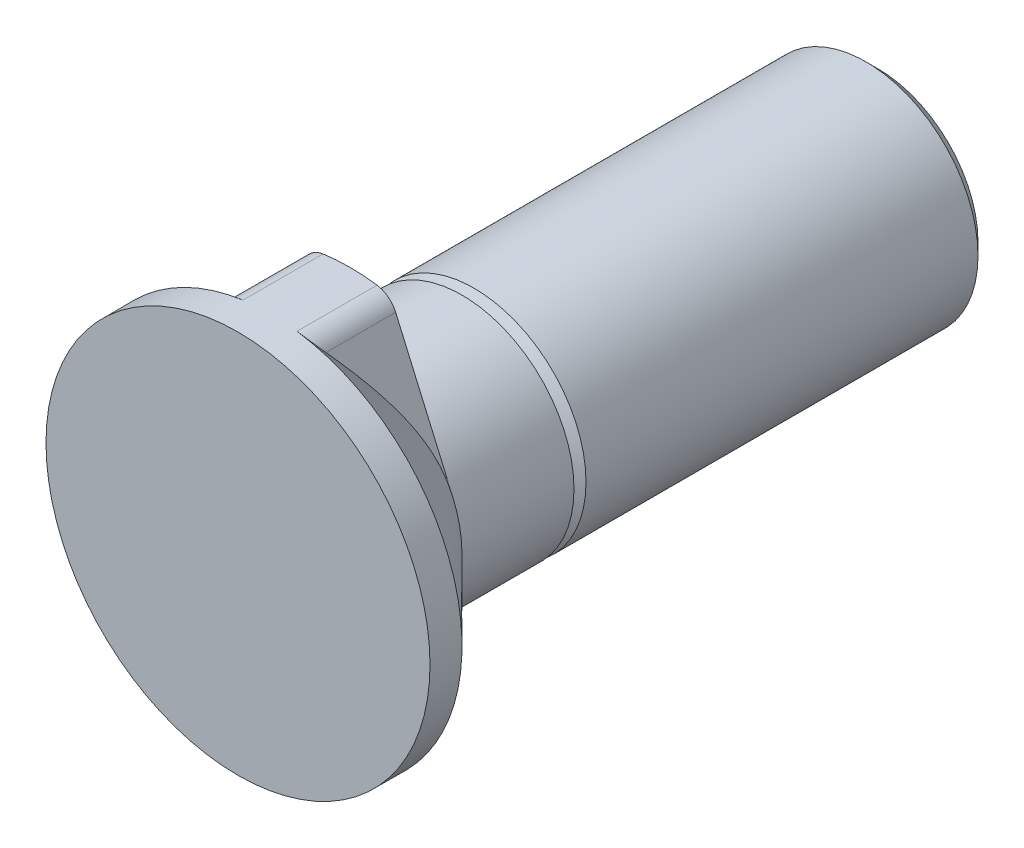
ISO-10303-21;
HEADER;
FILE_DESCRIPTION(('STEP AP214'),'2;1');
FILE_NAME('part.step','',(''),(''),'','','');
FILE_SCHEMA(('AUTOMOTIVE_DESIGN { 1 0 10303 214 1 1 1 1 }'));
ENDSEC;
DATA;
#1=APPLICATION_CONTEXT('core data for automotive mechanical design processes');
#2=APPLICATION_PROTOCOL_DEFINITION('international standard','automotive_design',2000,#1);
#3=PRODUCT_CONTEXT('',#1,'mechanical');
#4=PRODUCT('Part','Part','',(#3));
#5=PRODUCT_RELATED_PRODUCT_CATEGORY('part','',(#4));
#6=PRODUCT_DEFINITION_FORMATION('','',#4);
#7=PRODUCT_DEFINITION_CONTEXT('part definition',#1,'design');
#8=PRODUCT_DEFINITION('design','',#6,#7);
#9=PRODUCT_DEFINITION_SHAPE('','',#8);
#10=(LENGTH_UNIT() NAMED_UNIT(*) SI_UNIT(.MILLI.,.METRE.));
#11=(NAMED_UNIT(*) PLANE_ANGLE_UNIT() SI_UNIT($,.RADIAN.));
#12=(NAMED_UNIT(*) SI_UNIT($,.STERADIAN.) SOLID_ANGLE_UNIT());
#13=UNCERTAINTY_MEASURE_WITH_UNIT(LENGTH_MEASURE(1.E-05),#10,'distance_accuracy_value','');
#14=(GEOMETRIC_REPRESENTATION_CONTEXT(3) GLOBAL_UNCERTAINTY_ASSIGNED_CONTEXT((#13)) GLOBAL_UNIT_ASSIGNED_CONTEXT((#10,
#11,#12)) REPRESENTATION_CONTEXT('',''));
#15=CARTESIAN_POINT('',(0.,0.,0.));
#16=DIRECTION('',(0.,0.,1.));
#17=DIRECTION('',(1.,0.,0.));
#18=AXIS2_PLACEMENT_3D('',#15,#16,#17);
#19=CARTESIAN_POINT('',(0.,0.,-2.));
#20=DIRECTION('',(0.,0.,1.));
#21=DIRECTION('',(1.,0.,0.));
#22=AXIS2_PLACEMENT_3D('',#19,#20,#21);
#23=CONICAL_SURFACE('',#22,12.,0.785398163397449);
#24=CARTESIAN_POINT('',(0.,0.,-7.));
#25=DIRECTION('',(0.,0.,-1.));
#26=DIRECTION('',(-1.,0.,0.));
#27=AXIS2_PLACEMENT_3D('',#24,#25,#26);
#28=CIRCLE('',#27,7.);
#29=CARTESIAN_POINT('',(-6.41942052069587,-2.79124348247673,-7.));
#30=VERTEX_POINT('',#29);
#31=CARTESIAN_POINT('',(-6.41942052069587,2.79124348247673,-7.));
#32=VERTEX_POINT('',#31);
#33=EDGE_CURVE('E121',#30,#32,#28,.T.);
#34=ORIENTED_EDGE('',*,*,#33,.F.);
#35=CARTESIAN_POINT('',(-6.41950748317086,-2.79104348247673,-6.99999999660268));
#36=CARTESIAN_POINT('',(-6.37658002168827,-2.88976988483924,-7.0000158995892));
#37=CARTESIAN_POINT('',(-6.33365424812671,-2.98849240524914,-6.99752353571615));
#38=CARTESIAN_POINT('',(-6.24789997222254,-3.185713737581,-6.98761549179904));
#39=CARTESIAN_POINT('',(-6.20507145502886,-3.28421258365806,-6.98020062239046));
#40=CARTESIAN_POINT('',(-6.11967789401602,-3.48060432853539,-6.96056062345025));
#41=CARTESIAN_POINT('',(-6.07711249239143,-3.57849805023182,-6.94834525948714));
#42=CARTESIAN_POINT('',(-5.99223564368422,-3.77370143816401,-6.91928049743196));
#43=CARTESIAN_POINT('',(-5.9499242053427,-3.8710110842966,-6.9024309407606));
#44=CARTESIAN_POINT('',(-5.82496020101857,-4.15840861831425,-6.84592087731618));
#45=CARTESIAN_POINT('',(-5.74275261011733,-4.3474731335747,-6.79993211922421));
#46=CARTESIAN_POINT('',(-5.57990153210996,-4.72200497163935,-6.6928996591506));
#47=CARTESIAN_POINT('',(-5.49925881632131,-4.90747052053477,-6.63184872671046));
#48=CARTESIAN_POINT('',(-5.332023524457,-5.29208536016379,-6.49040662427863));
#49=CARTESIAN_POINT('',(-5.24560652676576,-5.49083084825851,-6.4087186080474));
#50=CARTESIAN_POINT('',(-5.07485190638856,-5.88353958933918,-6.23263024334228));
#51=CARTESIAN_POINT('',(-4.99051489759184,-6.0775014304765,-6.13822619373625));
#52=CARTESIAN_POINT('',(-4.82368633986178,-6.46118084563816,-5.93892547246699));
#53=CARTESIAN_POINT('',(-4.74119792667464,-6.65089120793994,-5.83401241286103));
#54=CARTESIAN_POINT('',(-4.57803275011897,-7.02614542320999,-5.61577938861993));
#55=CARTESIAN_POINT('',(-4.4973557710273,-7.21168977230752,-5.50246043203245));
#56=CARTESIAN_POINT('',(-4.33633561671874,-7.58201077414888,-5.26711087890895));
#57=CARTESIAN_POINT('',(-4.25601805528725,-7.76672851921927,-5.14497057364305));
#58=CARTESIAN_POINT('',(-4.09683116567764,-8.13283330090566,-4.89490258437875));
#59=CARTESIAN_POINT('',(-4.01796187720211,-8.31422024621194,-4.76697474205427));
#60=CARTESIAN_POINT('',(-3.86155387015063,-8.67393403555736,-4.50646245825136));
#61=CARTESIAN_POINT('',(-3.78401410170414,-8.85226329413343,-4.3738819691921));
#62=CARTESIAN_POINT('',(-3.63003731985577,-9.20638564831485,-4.10477176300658));
#63=CARTESIAN_POINT('',(-3.5536002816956,-9.38217880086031,-3.96824213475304));
#64=CARTESIAN_POINT('',(-3.39635594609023,-9.74381601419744,-3.68217594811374));
#65=CARTESIAN_POINT('',(-3.31561832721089,-9.92949982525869,-3.53239891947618));
#66=CARTESIAN_POINT('',(-3.15508921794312,-10.2986915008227,-3.22966849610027));
#67=CARTESIAN_POINT('',(-3.07529778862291,-10.4821992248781,-3.07671489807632));
#68=CARTESIAN_POINT('',(-2.91799877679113,-10.843962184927,-2.77097687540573));
#69=CARTESIAN_POINT('',(-2.84047616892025,-11.0222519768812,-2.6182409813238));
#70=CARTESIAN_POINT('',(-2.68613842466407,-11.377204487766,-2.31058395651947));
#71=CARTESIAN_POINT('',(-2.60932320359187,-11.5538674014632,-2.15566309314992));
#72=CARTESIAN_POINT('',(-2.53280838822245,-11.7298394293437,-1.99982286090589));
#73=B_SPLINE_CURVE_WITH_KNOTS('',3,(#35,#36,#37,#38,#39,#40,#41,#42,#43,#44,#45,#46,#47,#48,#49,
#50,#51,#52,#53,#54,#55,#56,#57,#58,#59,#60,#61,#62,#63,#64,#65,#66,#67,#68,#69,#70,#71,#72),
.UNSPECIFIED.,.F.,.F.,(4,2,2,2,2,2,2,2,2,2,2,2,2,2,2,2,2,2,4),(0.,0.32292990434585,
0.645806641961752,0.968029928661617,1.29026424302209,1.92324158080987,2.55652336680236,
3.25083605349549,3.94535126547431,4.64096689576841,5.33649924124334,6.04306902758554,
6.74965815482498,7.45566091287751,8.16164779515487,8.9171711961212,9.67274309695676,
10.4144319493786,11.1560308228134),.UNSPECIFIED.);
#74=CARTESIAN_POINT('',(-2.85290042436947,-10.9936781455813,-2.64218330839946));
#75=VERTEX_POINT('',#74);
#76=EDGE_CURVE('E110',#30,#75,#73,.T.);
#77=ORIENTED_EDGE('',*,*,#76,.T.);
#78=CARTESIAN_POINT('',(-2.85290042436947,-10.9936781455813,-2.64218330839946));
#79=CARTESIAN_POINT('',(-2.82054452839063,-11.068101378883,-2.5782519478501));
#80=CARTESIAN_POINT('',(-2.78123892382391,-11.1419287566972,-2.51635410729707));
#81=CARTESIAN_POINT('',(-2.68754612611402,-11.2859387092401,-2.3986540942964));
#82=CARTESIAN_POINT('',(-2.63303332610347,-11.3560848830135,-2.34290833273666));
#83=CARTESIAN_POINT('',(-2.52327720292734,-11.4729270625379,-2.2530114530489));
#84=CARTESIAN_POINT('',(-2.47136558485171,-11.5212044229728,-2.21689174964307));
#85=CARTESIAN_POINT('',(-2.35863477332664,-11.6114748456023,-2.15156675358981));
#86=CARTESIAN_POINT('',(-2.29783659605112,-11.6534822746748,-2.12234556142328));
#87=CARTESIAN_POINT('',(-2.16731075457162,-11.729597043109,-2.07206814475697));
#88=CARTESIAN_POINT('',(-2.09749042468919,-11.7636103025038,-2.0511073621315));
#89=CARTESIAN_POINT('',(-1.95142195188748,-11.8207989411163,-2.01945364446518));
#90=CARTESIAN_POINT('',(-1.8751916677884,-11.8440033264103,-2.00873314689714));
#91=CARTESIAN_POINT('',(-1.77937357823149,-11.864943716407,-2.00238722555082));
#92=CARTESIAN_POINT('',(-1.76125056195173,-11.8685523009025,-2.00149207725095));
#93=CARTESIAN_POINT('',(-1.72488866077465,-11.8750960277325,-2.00029960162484));
#94=CARTESIAN_POINT('',(-1.7066499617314,-11.8780320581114,-2.00000148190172));
#95=CARTESIAN_POINT('',(-1.68835464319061,-11.8806337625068,-2.));
#96=B_SPLINE_CURVE_WITH_KNOTS('',3,(#78,#79,#80,#81,#82,#83,#84,#85,#86,#87,#88,#89,#90,#91,#92,
#93,#94,#95),.UNSPECIFIED.,.F.,.F.,(4,2,2,2,2,2,2,2,4),(0.,0.310466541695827,0.623577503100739,
0.861350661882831,1.09857033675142,1.33845571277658,1.57769358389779,1.63318188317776,
1.68859648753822),.UNSPECIFIED.);
#97=CARTESIAN_POINT('',(-1.68835464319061,-11.8806337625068,-2.));
#98=VERTEX_POINT('',#97);
#99=EDGE_CURVE('E189',#75,#98,#96,.T.);
#100=ORIENTED_EDGE('',*,*,#99,.T.);
#101=CARTESIAN_POINT('',(0.,0.,-2.));
#102=DIRECTION('',(0.,0.,-1.));
#103=DIRECTION('',(-1.,0.,0.));
#104=AXIS2_PLACEMENT_3D('',#101,#102,#103);
#105=CIRCLE('',#104,12.);
#106=CARTESIAN_POINT('',(-1.68835464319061,11.8806337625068,-2.));
#107=VERTEX_POINT('',#106);
#108=EDGE_CURVE('E126',#98,#107,#105,.T.);
#109=ORIENTED_EDGE('',*,*,#108,.T.);
#110=CARTESIAN_POINT('',(-1.68835464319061,11.8806337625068,-2.));
#111=CARTESIAN_POINT('',(-1.72274997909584,11.8757537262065,-1.99999374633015));
#112=CARTESIAN_POINT('',(-1.75696816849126,11.869664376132,-2.00105579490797));
#113=CARTESIAN_POINT('',(-1.82475897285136,11.8551688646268,-2.00526833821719));
#114=CARTESIAN_POINT('',(-1.85833195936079,11.8467640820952,-2.0084175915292));
#115=CARTESIAN_POINT('',(-1.92435104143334,11.8278000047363,-2.01672734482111));
#116=CARTESIAN_POINT('',(-1.95680337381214,11.8172561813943,-2.02187363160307));
#117=CARTESIAN_POINT('',(-2.02059154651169,11.7941246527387,-2.03408796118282));
#118=CARTESIAN_POINT('',(-2.05192727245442,11.7815367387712,-2.04115620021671));
#119=CARTESIAN_POINT('',(-2.14382582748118,11.7409988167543,-2.06505826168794));
#120=CARTESIAN_POINT('',(-2.20247673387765,11.7102170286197,-2.08461503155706));
#121=CARTESIAN_POINT('',(-2.31352778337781,11.6425478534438,-2.12997086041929));
#122=CARTESIAN_POINT('',(-2.36591673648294,11.6056498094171,-2.15578085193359));
#123=CARTESIAN_POINT('',(-2.4803825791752,11.513975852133,-2.22212442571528));
#124=CARTESIAN_POINT('',(-2.53981013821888,11.4573559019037,-2.26469231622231));
#125=CARTESIAN_POINT('',(-2.64650598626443,11.3386310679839,-2.35679411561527));
#126=CARTESIAN_POINT('',(-2.69375138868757,11.2765161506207,-2.40634086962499));
#127=CARTESIAN_POINT('',(-2.78153523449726,11.1413431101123,-2.51684909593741));
#128=CARTESIAN_POINT('',(-2.82061379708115,11.06786080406,-2.57846743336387));
#129=CARTESIAN_POINT('',(-2.85290042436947,10.9936781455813,-2.64218330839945));
#130=B_SPLINE_CURVE_WITH_KNOTS('',3,(#110,#111,#112,#113,#114,#115,#116,#117,#118,#119,#120,
#121,#122,#123,#124,#125,#126,#127,#128,#129),.UNSPECIFIED.,.F.,.F.,(4,2,2,2,2,2,2,2,2,4),(0.,
0.104173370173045,0.208284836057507,0.311668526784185,0.41506277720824,0.621239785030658,
0.827779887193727,1.10363624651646,1.38000714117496,1.68915382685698),.UNSPECIFIED.);
#131=CARTESIAN_POINT('',(-2.85290042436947,10.9936781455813,-2.64218330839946));
#132=VERTEX_POINT('',#131);
#133=EDGE_CURVE('E210',#107,#132,#130,.T.);
#134=ORIENTED_EDGE('',*,*,#133,.T.);
#135=CARTESIAN_POINT('',(-2.53280838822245,11.7298394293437,-1.99982286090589));
#136=CARTESIAN_POINT('',(-2.60420635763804,11.5656353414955,-2.14524478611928));
#137=CARTESIAN_POINT('',(-2.67586652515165,11.4008282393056,-2.28986320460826));
#138=CARTESIAN_POINT('',(-2.81979373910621,11.0698183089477,-2.57721138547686));
#139=CARTESIAN_POINT('',(-2.89206082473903,10.9036153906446,-2.71994102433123));
#140=CARTESIAN_POINT('',(-3.03739267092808,10.5693750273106,-3.00344037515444));
#141=CARTESIAN_POINT('',(-3.11045853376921,10.4013350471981,-3.14420653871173));
#142=CARTESIAN_POINT('',(-3.25736579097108,10.0634714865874,-3.42316662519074));
#143=CARTESIAN_POINT('',(-3.33120717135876,9.8936479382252,-3.56136059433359));
#144=CARTESIAN_POINT('',(-3.48242962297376,9.54586010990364,-3.8396079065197));
#145=CARTESIAN_POINT('',(-3.5598429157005,9.36782172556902,-3.97955133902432));
#146=CARTESIAN_POINT('',(-3.7157596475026,9.00923779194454,-4.25556289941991));
#147=CARTESIAN_POINT('',(-3.79426305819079,8.82869230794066,-4.39163112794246));
#148=CARTESIAN_POINT('',(-3.95248167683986,8.46481439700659,-4.65903041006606));
#149=CARTESIAN_POINT('',(-4.03219617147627,8.28148361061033,-4.79036410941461));
#150=CARTESIAN_POINT('',(-4.19306088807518,7.91152009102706,-5.04736118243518));
#151=CARTESIAN_POINT('',(-4.27421100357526,7.72488760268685,-5.17302497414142));
#152=CARTESIAN_POINT('',(-4.45618498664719,7.30637609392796,-5.4443009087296));
#153=CARTESIAN_POINT('',(-4.55741217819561,7.07356949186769,-5.58822565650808));
#154=CARTESIAN_POINT('',(-4.76274706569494,6.60133158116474,-5.86280798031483));
#155=CARTESIAN_POINT('',(-4.866855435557,6.36189872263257,-5.99346241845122));
#156=CARTESIAN_POINT('',(-5.07688683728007,5.87885956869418,-6.23586339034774));
#157=CARTESIAN_POINT('',(-5.1827678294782,5.63534995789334,-6.34783656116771));
#158=CARTESIAN_POINT('',(-5.39778269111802,5.14084963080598,-6.55002694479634));
#159=CARTESIAN_POINT('',(-5.50691439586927,4.88986389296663,-6.64025828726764));
#160=CARTESIAN_POINT('',(-5.68235093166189,4.48638748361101,-6.76174277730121));
#161=CARTESIAN_POINT('',(-5.74767567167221,4.33615086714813,-6.80194572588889));
#162=CARTESIAN_POINT('',(-5.879197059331,4.03367238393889,-6.87192043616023));
#163=CARTESIAN_POINT('',(-5.94539344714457,3.88143111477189,-6.90169523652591));
#164=CARTESIAN_POINT('',(-6.07935764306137,3.57333455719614,-6.95022483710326));
#165=CARTESIAN_POINT('',(-6.14713457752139,3.41745827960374,-6.96882419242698));
#166=CARTESIAN_POINT('',(-6.24909185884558,3.18297258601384,-6.9874959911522));
#167=CARTESIAN_POINT('',(-6.28314570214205,3.10465410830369,-6.99218208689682));
#168=CARTESIAN_POINT('',(-6.35130114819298,2.9479073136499,-6.99843723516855));
#169=CARTESIAN_POINT('',(-6.38540275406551,2.86947898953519,-7.00000607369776));
#170=CARTESIAN_POINT('',(-6.41950748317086,2.79104348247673,-6.99999999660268));
#171=B_SPLINE_CURVE_WITH_KNOTS('',3,(#135,#136,#137,#138,#139,#140,#141,#142,#143,#144,#145,
#146,#147,#148,#149,#150,#151,#152,#153,#154,#155,#156,#157,#158,#159,#160,#161,#162,#163,#164,
#165,#166,#167,#168,#169,#170),.UNSPECIFIED.,.F.,.F.,(4,2,2,2,2,2,2,2,2,2,2,2,2,2,2,2,2,4),(0.,
0.692010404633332,1.38406584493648,2.07724205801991,2.77040580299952,3.48832962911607,
4.20623479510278,4.92373235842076,5.6411769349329,6.51633551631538,7.39170055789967,
8.25552108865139,9.11877871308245,9.62454457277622,10.1301629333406,10.6426605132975,
10.8992010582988,11.1557592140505),.UNSPECIFIED.);
#172=EDGE_CURVE('E142',#132,#32,#171,.T.);
#173=ORIENTED_EDGE('',*,*,#172,.T.);
#174=EDGE_LOOP('',(#34,#77,#100,#109,#134,#173));
#175=FACE_BOUND('',#174,.T.);
#176=ADVANCED_FACE('F17',(#175),#23,.T.);
#177=CARTESIAN_POINT('',(0.,0.,0.));
#178=DIRECTION('',(0.,0.,-1.));
#179=DIRECTION('',(-1.,0.,0.));
#180=AXIS2_PLACEMENT_3D('',#177,#178,#179);
#181=PLANE('',#180);
#182=CARTESIAN_POINT('',(0.,0.,0.));
#183=DIRECTION('',(0.,0.,-1.));
#184=DIRECTION('',(-1.,0.,0.));
#185=AXIS2_PLACEMENT_3D('',#182,#183,#184);
#186=CIRCLE('',#185,12.);
#187=CARTESIAN_POINT('',(-12.,0.,0.));
#188=VERTEX_POINT('',#187);
#189=EDGE_CURVE('E133',#188,#188,#186,.T.);
#190=ORIENTED_EDGE('',*,*,#189,.F.);
#191=EDGE_LOOP('',(#190));
#192=FACE_BOUND('',#191,.T.);
#193=ADVANCED_FACE('F19',(#192),#181,.F.);
#194=CARTESIAN_POINT('',(0.,0.,-50.));
#195=DIRECTION('',(0.,0.,-1.));
#196=DIRECTION('',(-1.,0.,0.));
#197=AXIS2_PLACEMENT_3D('',#194,#195,#196);
#198=CYLINDRICAL_SURFACE('',#197,12.);
#199=ORIENTED_EDGE('',*,*,#189,.T.);
#200=EDGE_LOOP('',(#199));
#201=FACE_BOUND('',#200,.T.);
#202=CARTESIAN_POINT('',(0.,0.,-7.));
#203=DIRECTION('',(0.,0.,1.));
#204=DIRECTION('',(1.,0.,0.));
#205=AXIS2_PLACEMENT_3D('',#202,#203,#204);
#206=CIRCLE('',#205,12.);
#207=CARTESIAN_POINT('',(-1.68835464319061,-11.8806337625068,-7.));
#208=VERTEX_POINT('',#207);
#209=CARTESIAN_POINT('',(1.68835464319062,-11.8806337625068,-7.));
#210=VERTEX_POINT('',#209);
#211=EDGE_CURVE('E102',#208,#210,#206,.T.);
#212=ORIENTED_EDGE('',*,*,#211,.T.);
#213=DIRECTION('',(0.,0.,-1.));
#214=VECTOR('',#213,1.);
#215=CARTESIAN_POINT('',(1.68835464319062,-11.8806337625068,-50.));
#216=LINE('',#215,#214);
#217=CARTESIAN_POINT('',(1.68835464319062,-11.8806337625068,-2.));
#218=VERTEX_POINT('',#217);
#219=EDGE_CURVE('E230',#210,#218,#216,.F.);
#220=ORIENTED_EDGE('',*,*,#219,.T.);
#221=CARTESIAN_POINT('',(1.68835464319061,11.8806337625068,-2.));
#222=VERTEX_POINT('',#221);
#223=EDGE_CURVE('E132',#222,#218,#105,.T.);
#224=ORIENTED_EDGE('',*,*,#223,.F.);
#225=DIRECTION('',(0.,0.,-1.));
#226=VECTOR('',#225,1.);
#227=CARTESIAN_POINT('',(1.68835464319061,11.8806337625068,-50.));
#228=LINE('',#227,#226);
#229=CARTESIAN_POINT('',(1.68835464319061,11.8806337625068,-7.));
#230=VERTEX_POINT('',#229);
#231=EDGE_CURVE('E220',#222,#230,#228,.T.);
#232=ORIENTED_EDGE('',*,*,#231,.T.);
#233=CARTESIAN_POINT('',(0.,0.,-7.));
#234=DIRECTION('',(0.,0.,1.));
#235=DIRECTION('',(1.,0.,0.));
#236=AXIS2_PLACEMENT_3D('',#233,#234,#235);
#237=CIRCLE('',#236,12.);
#238=CARTESIAN_POINT('',(-1.68835464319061,11.8806337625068,-7.));
#239=VERTEX_POINT('',#238);
#240=EDGE_CURVE('E550',#230,#239,#237,.T.);
#241=ORIENTED_EDGE('',*,*,#240,.T.);
#242=DIRECTION('',(0.,0.,-1.));
#243=VECTOR('',#242,1.);
#244=CARTESIAN_POINT('',(-1.68835464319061,11.8806337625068,-50.));
#245=LINE('',#244,#243);
#246=EDGE_CURVE('E195',#239,#107,#245,.F.);
#247=ORIENTED_EDGE('',*,*,#246,.T.);
#248=ORIENTED_EDGE('',*,*,#108,.F.);
#249=DIRECTION('',(0.,0.,-1.));
#250=VECTOR('',#249,1.);
#251=CARTESIAN_POINT('',(-1.68835464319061,-11.8806337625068,-50.));
#252=LINE('',#251,#250);
#253=EDGE_CURVE('E185',#98,#208,#252,.T.);
#254=ORIENTED_EDGE('',*,*,#253,.T.);
#255=EDGE_LOOP('',(#212,#220,#224,#232,#241,#247,#248,#254));
#256=FACE_BOUND('',#255,.T.);
#257=ADVANCED_FACE('F239',(#201,#256),#198,.T.);
#258=ORIENTED_EDGE('',*,*,#223,.T.);
#259=CARTESIAN_POINT('',(1.68835464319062,-11.8806337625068,-2.));
#260=CARTESIAN_POINT('',(1.72274997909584,-11.8757537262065,-1.99999374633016));
#261=CARTESIAN_POINT('',(1.75696816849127,-11.869664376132,-2.00105579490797));
#262=CARTESIAN_POINT('',(1.82475897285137,-11.8551688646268,-2.00526833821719));
#263=CARTESIAN_POINT('',(1.85833195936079,-11.8467640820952,-2.0084175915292));
#264=CARTESIAN_POINT('',(1.92435104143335,-11.8278000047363,-2.01672734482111));
#265=CARTESIAN_POINT('',(1.95680337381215,-11.8172561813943,-2.02187363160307));
#266=CARTESIAN_POINT('',(2.02059154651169,-11.7941246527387,-2.03408796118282));
#267=CARTESIAN_POINT('',(2.05192727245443,-11.7815367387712,-2.04115620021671));
#268=CARTESIAN_POINT('',(2.14382582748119,-11.7409988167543,-2.06505826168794));
#269=CARTESIAN_POINT('',(2.20247673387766,-11.7102170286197,-2.08461503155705));
#270=CARTESIAN_POINT('',(2.31352778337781,-11.6425478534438,-2.12997086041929));
#271=CARTESIAN_POINT('',(2.36591673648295,-11.6056498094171,-2.15578085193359));
#272=CARTESIAN_POINT('',(2.48038257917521,-11.513975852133,-2.22212442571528));
#273=CARTESIAN_POINT('',(2.53981013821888,-11.4573559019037,-2.26469231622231));
#274=CARTESIAN_POINT('',(2.64650598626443,-11.3386310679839,-2.35679411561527));
#275=CARTESIAN_POINT('',(2.69375138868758,-11.2765161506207,-2.40634086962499));
#276=CARTESIAN_POINT('',(2.78153523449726,-11.1413431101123,-2.51684909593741));
#277=CARTESIAN_POINT('',(2.82061379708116,-11.06786080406,-2.57846743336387));
#278=CARTESIAN_POINT('',(2.85290042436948,-10.9936781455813,-2.64218330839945));
#279=B_SPLINE_CURVE_WITH_KNOTS('',3,(#259,#260,#261,#262,#263,#264,#265,#266,#267,#268,#269,
#270,#271,#272,#273,#274,#275,#276,#277,#278),.UNSPECIFIED.,.F.,.F.,(4,2,2,2,2,2,2,2,2,4),(0.,
0.104173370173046,0.208284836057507,0.311668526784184,0.415062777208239,0.621239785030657,
0.827779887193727,1.10363624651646,1.38000714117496,1.68915382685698),.UNSPECIFIED.);
#280=CARTESIAN_POINT('',(2.85290042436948,-10.9936781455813,-2.64218330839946));
#281=VERTEX_POINT('',#280);
#282=EDGE_CURVE('E11',#218,#281,#279,.T.);
#283=ORIENTED_EDGE('',*,*,#282,.T.);
#284=CARTESIAN_POINT('',(2.53280838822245,-11.7298394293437,-1.99982286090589));
#285=CARTESIAN_POINT('',(2.60420635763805,-11.5656353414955,-2.14524478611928));
#286=CARTESIAN_POINT('',(2.67586652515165,-11.4008282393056,-2.28986320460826));
#287=CARTESIAN_POINT('',(2.81979373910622,-11.0698183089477,-2.57721138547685));
#288=CARTESIAN_POINT('',(2.89206082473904,-10.9036153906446,-2.71994102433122));
#289=CARTESIAN_POINT('',(3.03739267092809,-10.5693750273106,-3.00344037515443));
#290=CARTESIAN_POINT('',(3.11045853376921,-10.4013350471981,-3.14420653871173));
#291=CARTESIAN_POINT('',(3.25736579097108,-10.0634714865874,-3.42316662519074));
#292=CARTESIAN_POINT('',(3.33120717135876,-9.8936479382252,-3.56136059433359));
#293=CARTESIAN_POINT('',(3.48242962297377,-9.54586010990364,-3.8396079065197));
#294=CARTESIAN_POINT('',(3.55984291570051,-9.36782172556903,-3.97955133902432));
#295=CARTESIAN_POINT('',(3.7157596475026,-9.00923779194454,-4.25556289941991));
#296=CARTESIAN_POINT('',(3.7942630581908,-8.82869230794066,-4.39163112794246));
#297=CARTESIAN_POINT('',(3.95248167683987,-8.46481439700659,-4.65903041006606));
#298=CARTESIAN_POINT('',(4.03219617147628,-8.28148361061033,-4.79036410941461));
#299=CARTESIAN_POINT('',(4.19306088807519,-7.91152009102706,-5.04736118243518));
#300=CARTESIAN_POINT('',(4.27421100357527,-7.72488760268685,-5.17302497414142));
#301=CARTESIAN_POINT('',(4.4561849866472,-7.30637609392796,-5.4443009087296));
#302=CARTESIAN_POINT('',(4.55741217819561,-7.07356949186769,-5.58822565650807));
#303=CARTESIAN_POINT('',(4.76274706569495,-6.60133158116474,-5.86280798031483));
#304=CARTESIAN_POINT('',(4.86685543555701,-6.36189872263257,-5.99346241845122));
#305=CARTESIAN_POINT('',(5.07688683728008,-5.87885956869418,-6.23586339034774));
#306=CARTESIAN_POINT('',(5.18276782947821,-5.63534995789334,-6.3478365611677));
#307=CARTESIAN_POINT('',(5.39778269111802,-5.14084963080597,-6.55002694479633));
#308=CARTESIAN_POINT('',(5.50691439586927,-4.88986389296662,-6.64025828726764));
#309=CARTESIAN_POINT('',(5.6823509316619,-4.486387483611,-6.76174277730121));
#310=CARTESIAN_POINT('',(5.74767567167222,-4.33615086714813,-6.80194572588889));
#311=CARTESIAN_POINT('',(5.87919705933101,-4.03367238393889,-6.87192043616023));
#312=CARTESIAN_POINT('',(5.94539344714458,-3.88143111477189,-6.90169523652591));
#313=CARTESIAN_POINT('',(6.07935764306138,-3.57333455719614,-6.95022483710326));
#314=CARTESIAN_POINT('',(6.1471345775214,-3.41745827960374,-6.96882419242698));
#315=CARTESIAN_POINT('',(6.24909185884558,-3.18297258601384,-6.9874959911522));
#316=CARTESIAN_POINT('',(6.28314570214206,-3.10465410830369,-6.99218208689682));
#317=CARTESIAN_POINT('',(6.35130114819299,-2.9479073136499,-6.99843723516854));
#318=CARTESIAN_POINT('',(6.38540275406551,-2.86947898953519,-7.00000607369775));
#319=CARTESIAN_POINT('',(6.41950748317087,-2.79104348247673,-6.99999999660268));
#320=B_SPLINE_CURVE_WITH_KNOTS('',3,(#284,#285,#286,#287,#288,#289,#290,#291,#292,#293,#294,
#295,#296,#297,#298,#299,#300,#301,#302,#303,#304,#305,#306,#307,#308,#309,#310,#311,#312,#313,
#314,#315,#316,#317,#318,#319),.UNSPECIFIED.,.F.,.F.,(4,2,2,2,2,2,2,2,2,2,2,2,2,2,2,2,2,4),(0.,
0.692010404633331,1.38406584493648,2.07724205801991,2.77040580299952,3.48832962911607,
4.20623479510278,4.92373235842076,5.64117693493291,6.51633551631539,7.39170055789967,
8.2555210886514,9.11877871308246,9.62454457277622,10.1301629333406,10.6426605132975,
10.8992010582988,11.1557592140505),.UNSPECIFIED.);
#321=CARTESIAN_POINT('',(6.41942052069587,-2.79124348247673,-7.));
#322=VERTEX_POINT('',#321);
#323=EDGE_CURVE('E97',#281,#322,#320,.T.);
#324=ORIENTED_EDGE('',*,*,#323,.T.);
#325=CARTESIAN_POINT('',(6.41942052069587,2.79124348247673,-7.));
#326=VERTEX_POINT('',#325);
#327=EDGE_CURVE('E108',#326,#322,#28,.T.);
#328=ORIENTED_EDGE('',*,*,#327,.F.);
#329=CARTESIAN_POINT('',(6.41950748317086,2.79104348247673,-6.99999999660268));
#330=CARTESIAN_POINT('',(6.37658002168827,2.88976988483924,-7.0000158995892));
#331=CARTESIAN_POINT('',(6.33365424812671,2.98849240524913,-6.99752353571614));
#332=CARTESIAN_POINT('',(6.24789997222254,3.18571373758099,-6.98761549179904));
#333=CARTESIAN_POINT('',(6.20507145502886,3.28421258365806,-6.98020062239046));
#334=CARTESIAN_POINT('',(6.11967789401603,3.48060432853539,-6.96056062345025));
#335=CARTESIAN_POINT('',(6.07711249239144,3.57849805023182,-6.94834525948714));
#336=CARTESIAN_POINT('',(5.99223564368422,3.77370143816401,-6.91928049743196));
#337=CARTESIAN_POINT('',(5.9499242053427,3.8710110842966,-6.9024309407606));
#338=CARTESIAN_POINT('',(5.82496020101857,4.15840861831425,-6.84592087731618));
#339=CARTESIAN_POINT('',(5.74275261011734,4.3474731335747,-6.79993211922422));
#340=CARTESIAN_POINT('',(5.57990153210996,4.72200497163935,-6.6928996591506));
#341=CARTESIAN_POINT('',(5.49925881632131,4.90747052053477,-6.63184872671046));
#342=CARTESIAN_POINT('',(5.332023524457,5.29208536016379,-6.49040662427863));
#343=CARTESIAN_POINT('',(5.24560652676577,5.4908308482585,-6.4087186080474));
#344=CARTESIAN_POINT('',(5.07485190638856,5.88353958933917,-6.23263024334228));
#345=CARTESIAN_POINT('',(4.99051489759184,6.0775014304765,-6.13822619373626));
#346=CARTESIAN_POINT('',(4.82368633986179,6.46118084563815,-5.93892547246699));
#347=CARTESIAN_POINT('',(4.74119792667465,6.65089120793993,-5.83401241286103));
#348=CARTESIAN_POINT('',(4.57803275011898,7.02614542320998,-5.61577938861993));
#349=CARTESIAN_POINT('',(4.4973557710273,7.21168977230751,-5.50246043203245));
#350=CARTESIAN_POINT('',(4.33633561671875,7.58201077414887,-5.26711087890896));
#351=CARTESIAN_POINT('',(4.25601805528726,7.76672851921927,-5.14497057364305));
#352=CARTESIAN_POINT('',(4.09683116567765,8.13283330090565,-4.89490258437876));
#353=CARTESIAN_POINT('',(4.01796187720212,8.31422024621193,-4.76697474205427));
#354=CARTESIAN_POINT('',(3.86155387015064,8.67393403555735,-4.50646245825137));
#355=CARTESIAN_POINT('',(3.78401410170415,8.85226329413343,-4.37388196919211));
#356=CARTESIAN_POINT('',(3.63003731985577,9.20638564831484,-4.10477176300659));
#357=CARTESIAN_POINT('',(3.55360028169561,9.3821788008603,-3.96824213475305));
#358=CARTESIAN_POINT('',(3.39635594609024,9.74381601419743,-3.68217594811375));
#359=CARTESIAN_POINT('',(3.3156183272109,9.92949982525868,-3.53239891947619));
#360=CARTESIAN_POINT('',(3.15508921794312,10.2986915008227,-3.22966849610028));
#361=CARTESIAN_POINT('',(3.07529778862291,10.4821992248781,-3.07671489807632));
#362=CARTESIAN_POINT('',(2.91799877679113,10.843962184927,-2.77097687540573));
#363=CARTESIAN_POINT('',(2.84047616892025,11.0222519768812,-2.6182409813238));
#364=CARTESIAN_POINT('',(2.68613842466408,11.377204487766,-2.31058395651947));
#365=CARTESIAN_POINT('',(2.60932320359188,11.5538674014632,-2.15566309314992));
#366=CARTESIAN_POINT('',(2.53280838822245,11.7298394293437,-1.99982286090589));
#367=B_SPLINE_CURVE_WITH_KNOTS('',3,(#329,#330,#331,#332,#333,#334,#335,#336,#337,#338,#339,
#340,#341,#342,#343,#344,#345,#346,#347,#348,#349,#350,#351,#352,#353,#354,#355,#356,#357,#358,
#359,#360,#361,#362,#363,#364,#365,#366),.UNSPECIFIED.,.F.,.F.,(4,2,2,2,2,2,2,2,2,2,2,2,2,2,2,2,
2,2,4),(0.,0.322929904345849,0.645806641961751,0.968029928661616,1.29026424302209,
1.92324158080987,2.55652336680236,3.25083605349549,3.9453512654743,4.6409668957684,
5.33649924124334,6.04306902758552,6.74965815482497,7.45566091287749,8.16164779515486,
8.91717119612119,9.67274309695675,10.4144319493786,11.1560308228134),.UNSPECIFIED.);
#368=CARTESIAN_POINT('',(2.85290042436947,10.9936781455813,-2.64218330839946));
#369=VERTEX_POINT('',#368);
#370=EDGE_CURVE('E111',#326,#369,#367,.T.);
#371=ORIENTED_EDGE('',*,*,#370,.T.);
#372=CARTESIAN_POINT('',(2.85290042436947,10.9936781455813,-2.64218330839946));
#373=CARTESIAN_POINT('',(2.82054452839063,11.068101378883,-2.5782519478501));
#374=CARTESIAN_POINT('',(2.78123892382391,11.1419287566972,-2.51635410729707));
#375=CARTESIAN_POINT('',(2.68754612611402,11.2859387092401,-2.39865409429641));
#376=CARTESIAN_POINT('',(2.63303332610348,11.3560848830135,-2.34290833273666));
#377=CARTESIAN_POINT('',(2.52327720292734,11.4729270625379,-2.2530114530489));
#378=CARTESIAN_POINT('',(2.47136558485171,11.5212044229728,-2.21689174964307));
#379=CARTESIAN_POINT('',(2.35863477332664,11.6114748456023,-2.15156675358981));
#380=CARTESIAN_POINT('',(2.29783659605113,11.6534822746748,-2.12234556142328));
#381=CARTESIAN_POINT('',(2.16731075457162,11.729597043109,-2.07206814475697));
#382=CARTESIAN_POINT('',(2.09749042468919,11.7636103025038,-2.0511073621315));
#383=CARTESIAN_POINT('',(1.95142195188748,11.8207989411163,-2.01945364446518));
#384=CARTESIAN_POINT('',(1.8751916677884,11.8440033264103,-2.00873314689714));
#385=CARTESIAN_POINT('',(1.77937357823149,11.864943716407,-2.00238722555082));
#386=CARTESIAN_POINT('',(1.76125056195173,11.8685523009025,-2.00149207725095));
#387=CARTESIAN_POINT('',(1.72488866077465,11.8750960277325,-2.00029960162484));
#388=CARTESIAN_POINT('',(1.7066499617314,11.8780320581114,-2.00000148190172));
#389=CARTESIAN_POINT('',(1.68835464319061,11.8806337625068,-2.));
#390=B_SPLINE_CURVE_WITH_KNOTS('',3,(#372,#373,#374,#375,#376,#377,#378,#379,#380,#381,#382,
#383,#384,#385,#386,#387,#388,#389),.UNSPECIFIED.,.F.,.F.,(4,2,2,2,2,2,2,2,4),(0.,
0.310466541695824,0.623577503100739,0.86135066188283,1.09857033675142,1.33845571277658,
1.57769358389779,1.63318188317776,1.68859648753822),.UNSPECIFIED.);
#391=EDGE_CURVE('E224',#369,#222,#390,.T.);
#392=ORIENTED_EDGE('',*,*,#391,.T.);
#393=EDGE_LOOP('',(#258,#283,#324,#328,#371,#392));
#394=FACE_BOUND('',#393,.T.);
#395=ADVANCED_FACE('F105',(#394),#23,.T.);
#396=CARTESIAN_POINT('',(0.,0.,-50.));
#397=DIRECTION('',(0.,0.,-1.));
#398=DIRECTION('',(-1.,0.,0.));
#399=AXIS2_PLACEMENT_3D('',#396,#397,#398);
#400=CYLINDRICAL_SURFACE('',#399,7.);
#401=CARTESIAN_POINT('',(0.,0.,-14.));
#402=DIRECTION('',(0.,0.,-1.));
#403=DIRECTION('',(-1.,0.,0.));
#404=AXIS2_PLACEMENT_3D('',#401,#402,#403);
#405=CIRCLE('',#404,7.);
#406=CARTESIAN_POINT('',(-6.99999999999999,0.,-14.));
#407=VERTEX_POINT('',#406);
#408=EDGE_CURVE('E129',#407,#407,#405,.T.);
#409=ORIENTED_EDGE('',*,*,#408,.F.);
#410=EDGE_LOOP('',(#409));
#411=FACE_BOUND('',#410,.T.);
#412=EDGE_CURVE('E125',#32,#326,#28,.T.);
#413=ORIENTED_EDGE('',*,*,#412,.T.);
#414=ORIENTED_EDGE('',*,*,#327,.T.);
#415=EDGE_CURVE('E114',#322,#30,#28,.T.);
#416=ORIENTED_EDGE('',*,*,#415,.T.);
#417=ORIENTED_EDGE('',*,*,#33,.T.);
#418=EDGE_LOOP('',(#413,#414,#416,#417));
#419=FACE_BOUND('',#418,.T.);
#420=ADVANCED_FACE('F123',(#411,#419),#400,.T.);
#421=CARTESIAN_POINT('',(-6.99999999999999,0.,-14.));
#422=DIRECTION('',(0.,0.,1.));
#423=DIRECTION('',(1.,0.,0.));
#424=AXIS2_PLACEMENT_3D('',#421,#422,#423);
#425=PLANE('',#424);
#426=CARTESIAN_POINT('',(0.,0.,-14.));
#427=DIRECTION('',(0.,0.,-1.));
#428=DIRECTION('',(-1.,0.,0.));
#429=AXIS2_PLACEMENT_3D('',#426,#427,#428);
#430=CIRCLE('',#429,5.70096189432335);
#431=CARTESIAN_POINT('',(-5.70096189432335,0.,-14.));
#432=VERTEX_POINT('',#431);
#433=EDGE_CURVE('E540',#432,#432,#430,.T.);
#434=ORIENTED_EDGE('',*,*,#433,.F.);
#435=EDGE_LOOP('',(#434));
#436=FACE_BOUND('',#435,.T.);
#437=ORIENTED_EDGE('',*,*,#408,.T.);
#438=EDGE_LOOP('',(#437));
#439=FACE_BOUND('',#438,.T.);
#440=ADVANCED_FACE('F262',(#436,#439),#425,.F.);
#441=CARTESIAN_POINT('',(0.,0.,-14.));
#442=DIRECTION('',(0.,0.,-1.));
#443=DIRECTION('',(-1.,0.,0.));
#444=AXIS2_PLACEMENT_3D('',#441,#442,#443);
#445=CONICAL_SURFACE('',#444,5.70096189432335,1.0471975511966);
#446=CARTESIAN_POINT('',(0.,0.,-14.75));
#447=DIRECTION('',(0.,0.,-1.));
#448=DIRECTION('',(-1.,0.,0.));
#449=AXIS2_PLACEMENT_3D('',#446,#447,#448);
#450=CIRCLE('',#449,7.);
#451=CARTESIAN_POINT('',(-7.,0.,-14.75));
#452=VERTEX_POINT('',#451);
#453=EDGE_CURVE('E543',#452,#452,#450,.T.);
#454=ORIENTED_EDGE('',*,*,#453,.F.);
#455=EDGE_LOOP('',(#454));
#456=FACE_BOUND('',#455,.T.);
#457=ORIENTED_EDGE('',*,*,#433,.T.);
#458=EDGE_LOOP('',(#457));
#459=FACE_BOUND('',#458,.T.);
#460=ADVANCED_FACE('F453',(#456,#459),#445,.T.);
#461=CARTESIAN_POINT('',(0.,0.,-50.));
#462=DIRECTION('',(0.,0.,-1.));
#463=DIRECTION('',(-1.,0.,0.));
#464=AXIS2_PLACEMENT_3D('',#461,#462,#463);
#465=CYLINDRICAL_SURFACE('',#464,7.);
#466=CARTESIAN_POINT('',(0.,0.,-39.25));
#467=DIRECTION('',(0.,0.,1.));
#468=DIRECTION('',(1.,0.,0.));
#469=AXIS2_PLACEMENT_3D('',#466,#467,#468);
#470=CIRCLE('',#469,7.);
#471=CARTESIAN_POINT('',(7.,0.,-39.25));
#472=VERTEX_POINT('',#471);
#473=EDGE_CURVE('E139',#472,#472,#470,.T.);
#474=ORIENTED_EDGE('',*,*,#473,.T.);
#475=EDGE_LOOP('',(#474));
#476=FACE_BOUND('',#475,.T.);
#477=ORIENTED_EDGE('',*,*,#453,.T.);
#478=EDGE_LOOP('',(#477));
#479=FACE_BOUND('',#478,.T.);
#480=ADVANCED_FACE('F442',(#476,#479),#465,.T.);
#481=CARTESIAN_POINT('',(-7.,0.,-40.));
#482=DIRECTION('',(0.,0.,1.));
#483=DIRECTION('',(1.,0.,0.));
#484=AXIS2_PLACEMENT_3D('',#481,#482,#483);
#485=PLANE('',#484);
#486=CARTESIAN_POINT('',(0.,0.,-40.));
#487=DIRECTION('',(0.,0.,1.));
#488=DIRECTION('',(1.,0.,0.));
#489=AXIS2_PLACEMENT_3D('',#486,#487,#488);
#490=CIRCLE('',#489,6.25);
#491=CARTESIAN_POINT('',(6.25,0.,-40.));
#492=VERTEX_POINT('',#491);
#493=EDGE_CURVE('E136',#492,#492,#490,.F.);
#494=ORIENTED_EDGE('',*,*,#493,.T.);
#495=EDGE_LOOP('',(#494));
#496=FACE_BOUND('',#495,.T.);
#497=ADVANCED_FACE('F432',(#496),#485,.F.);
#498=CARTESIAN_POINT('',(0.,0.,-40.));
#499=DIRECTION('',(0.,0.,1.));
#500=DIRECTION('',(1.,0.,0.));
#501=AXIS2_PLACEMENT_3D('',#498,#499,#500);
#502=CONICAL_SURFACE('',#501,6.25,0.785398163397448);
#503=ORIENTED_EDGE('',*,*,#473,.F.);
#504=EDGE_LOOP('',(#503));
#505=FACE_BOUND('',#504,.T.);
#506=ORIENTED_EDGE('',*,*,#493,.F.);
#507=EDGE_LOOP('',(#506));
#508=FACE_BOUND('',#507,.T.);
#509=ADVANCED_FACE('F323',(#505,#508),#502,.T.);
#510=CARTESIAN_POINT('',(0.,0.,-7.));
#511=DIRECTION('',(0.,0.,1.));
#512=DIRECTION('',(1.,0.,0.));
#513=AXIS2_PLACEMENT_3D('',#510,#511,#512);
#514=PLANE('',#513);
#515=DIRECTION('',(0.398749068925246,0.917060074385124,0.));
#516=VECTOR('',#515,1.);
#517=CARTESIAN_POINT('',(6.41942052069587,-2.79124348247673,-7.));
#518=LINE('',#517,#516);
#519=CARTESIAN_POINT('',(2.85290042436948,-10.9936781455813,-7.));
#520=VERTEX_POINT('',#519);
#521=EDGE_CURVE('E95',#520,#322,#518,.T.);
#522=ORIENTED_EDGE('',*,*,#521,.F.);
#523=CARTESIAN_POINT('',(1.47731031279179,-10.3955545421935,-7.));
#524=DIRECTION('',(0.,0.,1.));
#525=DIRECTION('',(1.,0.,0.));
#526=AXIS2_PLACEMENT_3D('',#523,#524,#525);
#527=CIRCLE('',#526,1.5);
#528=EDGE_CURVE('E30',#520,#210,#527,.F.);
#529=ORIENTED_EDGE('',*,*,#528,.T.);
#530=ORIENTED_EDGE('',*,*,#211,.F.);
#531=CARTESIAN_POINT('',(-1.47731031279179,-10.3955545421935,-7.));
#532=DIRECTION('',(0.,0.,1.));
#533=DIRECTION('',(1.,0.,0.));
#534=AXIS2_PLACEMENT_3D('',#531,#532,#533);
#535=CIRCLE('',#534,1.5);
#536=CARTESIAN_POINT('',(-2.85290042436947,-10.9936781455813,-7.));
#537=VERTEX_POINT('',#536);
#538=EDGE_CURVE('E187',#208,#537,#535,.F.);
#539=ORIENTED_EDGE('',*,*,#538,.T.);
#540=DIRECTION('',(0.398749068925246,-0.917060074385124,0.));
#541=VECTOR('',#540,1.);
#542=CARTESIAN_POINT('',(-6.41942052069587,-2.79124348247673,-7.));
#543=LINE('',#542,#541);
#544=EDGE_CURVE('E117',#30,#537,#543,.T.);
#545=ORIENTED_EDGE('',*,*,#544,.F.);
#546=ORIENTED_EDGE('',*,*,#415,.F.);
#547=EDGE_LOOP('',(#522,#529,#530,#539,#545,#546));
#548=FACE_BOUND('',#547,.T.);
#549=ADVANCED_FACE('F115',(#548),#514,.F.);
#550=CARTESIAN_POINT('',(6.41942052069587,-2.79124348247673,-7.));
#551=DIRECTION('',(0.917060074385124,-0.398749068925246,0.));
#552=DIRECTION('',(0.398749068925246,0.917060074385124,0.));
#553=AXIS2_PLACEMENT_3D('',#550,#551,#552);
#554=PLANE('',#553);
#555=ORIENTED_EDGE('',*,*,#323,.F.);
#556=DIRECTION('',(0.,0.,1.));
#557=VECTOR('',#556,1.);
#558=CARTESIAN_POINT('',(2.85290042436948,-10.9936781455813,-7.));
#559=LINE('',#558,#557);
#560=EDGE_CURVE('E37',#281,#520,#559,.F.);
#561=ORIENTED_EDGE('',*,*,#560,.T.);
#562=ORIENTED_EDGE('',*,*,#521,.T.);
#563=EDGE_LOOP('',(#555,#561,#562));
#564=FACE_BOUND('',#563,.T.);
#565=ADVANCED_FACE('F96',(#564),#554,.T.);
#566=CARTESIAN_POINT('',(-6.41942052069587,-2.79124348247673,-7.));
#567=DIRECTION('',(-0.917060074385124,-0.398749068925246,0.));
#568=DIRECTION('',(0.398749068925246,-0.917060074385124,0.));
#569=AXIS2_PLACEMENT_3D('',#566,#567,#568);
#570=PLANE('',#569);
#571=ORIENTED_EDGE('',*,*,#544,.T.);
#572=DIRECTION('',(0.,0.,1.));
#573=VECTOR('',#572,1.);
#574=CARTESIAN_POINT('',(-2.85290042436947,-10.9936781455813,-2.));
#575=LINE('',#574,#573);
#576=EDGE_CURVE('E182',#537,#75,#575,.T.);
#577=ORIENTED_EDGE('',*,*,#576,.T.);
#578=ORIENTED_EDGE('',*,*,#76,.F.);
#579=EDGE_LOOP('',(#571,#577,#578));
#580=FACE_BOUND('',#579,.T.);
#581=ADVANCED_FACE('F166',(#580),#570,.T.);
#582=CARTESIAN_POINT('',(6.41942052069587,2.79124348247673,-7.));
#583=DIRECTION('',(0.917060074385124,0.398749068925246,0.));
#584=DIRECTION('',(-0.398749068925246,0.917060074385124,0.));
#585=AXIS2_PLACEMENT_3D('',#582,#583,#584);
#586=PLANE('',#585);
#587=DIRECTION('',(-0.398749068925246,0.917060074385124,0.));
#588=VECTOR('',#587,1.);
#589=CARTESIAN_POINT('',(6.41942052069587,2.79124348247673,-7.));
#590=LINE('',#589,#588);
#591=CARTESIAN_POINT('',(2.85290042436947,10.9936781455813,-7.));
#592=VERTEX_POINT('',#591);
#593=EDGE_CURVE('E101',#326,#592,#590,.T.);
#594=ORIENTED_EDGE('',*,*,#593,.T.);
#595=DIRECTION('',(0.,0.,1.));
#596=VECTOR('',#595,1.);
#597=CARTESIAN_POINT('',(2.85290042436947,10.9936781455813,-2.));
#598=LINE('',#597,#596);
#599=EDGE_CURVE('E216',#592,#369,#598,.T.);
#600=ORIENTED_EDGE('',*,*,#599,.T.);
#601=ORIENTED_EDGE('',*,*,#370,.F.);
#602=EDGE_LOOP('',(#594,#600,#601));
#603=FACE_BOUND('',#602,.T.);
#604=ADVANCED_FACE('F160',(#603),#586,.T.);
#605=CARTESIAN_POINT('',(-6.41942052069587,2.79124348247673,-7.));
#606=DIRECTION('',(-0.917060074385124,0.398749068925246,0.));
#607=DIRECTION('',(-0.398749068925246,-0.917060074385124,0.));
#608=AXIS2_PLACEMENT_3D('',#605,#606,#607);
#609=PLANE('',#608);
#610=ORIENTED_EDGE('',*,*,#172,.F.);
#611=DIRECTION('',(0.,0.,1.));
#612=VECTOR('',#611,1.);
#613=CARTESIAN_POINT('',(-2.85290042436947,10.9936781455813,-7.));
#614=LINE('',#613,#612);
#615=CARTESIAN_POINT('',(-2.85290042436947,10.9936781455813,-7.));
#616=VERTEX_POINT('',#615);
#617=EDGE_CURVE('E568',#132,#616,#614,.F.);
#618=ORIENTED_EDGE('',*,*,#617,.T.);
#619=DIRECTION('',(-0.398749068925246,-0.917060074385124,0.));
#620=VECTOR('',#619,1.);
#621=CARTESIAN_POINT('',(-6.41942052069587,2.79124348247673,-7.));
#622=LINE('',#621,#620);
#623=EDGE_CURVE('E546',#616,#32,#622,.T.);
#624=ORIENTED_EDGE('',*,*,#623,.T.);
#625=EDGE_LOOP('',(#610,#618,#624));
#626=FACE_BOUND('',#625,.T.);
#627=ADVANCED_FACE('F155',(#626),#609,.T.);
#628=ORIENTED_EDGE('',*,*,#240,.F.);
#629=CARTESIAN_POINT('',(1.47731031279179,10.3955545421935,-7.));
#630=DIRECTION('',(0.,0.,1.));
#631=DIRECTION('',(1.,0.,0.));
#632=AXIS2_PLACEMENT_3D('',#629,#630,#631);
#633=CIRCLE('',#632,1.5);
#634=EDGE_CURVE('E222',#230,#592,#633,.F.);
#635=ORIENTED_EDGE('',*,*,#634,.T.);
#636=ORIENTED_EDGE('',*,*,#593,.F.);
#637=ORIENTED_EDGE('',*,*,#412,.F.);
#638=ORIENTED_EDGE('',*,*,#623,.F.);
#639=CARTESIAN_POINT('',(-1.47731031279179,10.3955545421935,-7.));
#640=DIRECTION('',(0.,0.,1.));
#641=DIRECTION('',(1.,0.,0.));
#642=AXIS2_PLACEMENT_3D('',#639,#640,#641);
#643=CIRCLE('',#642,1.5);
#644=EDGE_CURVE('E217',#616,#239,#643,.F.);
#645=ORIENTED_EDGE('',*,*,#644,.T.);
#646=EDGE_LOOP('',(#628,#635,#636,#637,#638,#645));
#647=FACE_BOUND('',#646,.T.);
#648=ADVANCED_FACE('F159',(#647),#514,.F.);
#649=CARTESIAN_POINT('',(-1.47731031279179,-10.3955545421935,-50.));
#650=DIRECTION('',(0.,0.,-1.));
#651=DIRECTION('',(-1.,0.,0.));
#652=AXIS2_PLACEMENT_3D('',#649,#650,#651);
#653=CYLINDRICAL_SURFACE('',#652,1.5);
#654=ORIENTED_EDGE('',*,*,#538,.F.);
#655=ORIENTED_EDGE('',*,*,#253,.F.);
#656=ORIENTED_EDGE('',*,*,#99,.F.);
#657=ORIENTED_EDGE('',*,*,#576,.F.);
#658=EDGE_LOOP('',(#654,#655,#656,#657));
#659=FACE_BOUND('',#658,.T.);
#660=ADVANCED_FACE('F197',(#659),#653,.T.);
#661=CARTESIAN_POINT('',(-1.47731031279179,10.3955545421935,-50.));
#662=DIRECTION('',(0.,0.,-1.));
#663=DIRECTION('',(-1.,0.,0.));
#664=AXIS2_PLACEMENT_3D('',#661,#662,#663);
#665=CYLINDRICAL_SURFACE('',#664,1.5);
#666=ORIENTED_EDGE('',*,*,#644,.F.);
#667=ORIENTED_EDGE('',*,*,#617,.F.);
#668=ORIENTED_EDGE('',*,*,#133,.F.);
#669=ORIENTED_EDGE('',*,*,#246,.F.);
#670=EDGE_LOOP('',(#666,#667,#668,#669));
#671=FACE_BOUND('',#670,.T.);
#672=ADVANCED_FACE('F201',(#671),#665,.T.);
#673=CARTESIAN_POINT('',(1.47731031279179,10.3955545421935,-50.));
#674=DIRECTION('',(0.,0.,-1.));
#675=DIRECTION('',(-1.,0.,0.));
#676=AXIS2_PLACEMENT_3D('',#673,#674,#675);
#677=CYLINDRICAL_SURFACE('',#676,1.5);
#678=ORIENTED_EDGE('',*,*,#634,.F.);
#679=ORIENTED_EDGE('',*,*,#231,.F.);
#680=ORIENTED_EDGE('',*,*,#391,.F.);
#681=ORIENTED_EDGE('',*,*,#599,.F.);
#682=EDGE_LOOP('',(#678,#679,#680,#681));
#683=FACE_BOUND('',#682,.T.);
#684=ADVANCED_FACE('F206',(#683),#677,.T.);
#685=CARTESIAN_POINT('',(1.47731031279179,-10.3955545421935,-50.));
#686=DIRECTION('',(0.,0.,-1.));
#687=DIRECTION('',(-1.,0.,0.));
#688=AXIS2_PLACEMENT_3D('',#685,#686,#687);
#689=CYLINDRICAL_SURFACE('',#688,1.5);
#690=ORIENTED_EDGE('',*,*,#528,.F.);
#691=ORIENTED_EDGE('',*,*,#560,.F.);
#692=ORIENTED_EDGE('',*,*,#282,.F.);
#693=ORIENTED_EDGE('',*,*,#219,.F.);
#694=EDGE_LOOP('',(#690,#691,#692,#693));
#695=FACE_BOUND('',#694,.T.);
#696=ADVANCED_FACE('F242',(#695),#689,.T.);
#697=CLOSED_SHELL('',(#176,#193,#257,#395,#420,#440,#460,#480,#497,#509,#549,#565,#581,#604,
#627,#648,#660,#672,#684,#696));
#698=MANIFOLD_SOLID_BREP('B1',#697);
#699=ADVANCED_BREP_SHAPE_REPRESENTATION('',(#18,#698),#14);
#700=SHAPE_DEFINITION_REPRESENTATION(#9,#699);
ENDSEC;
END-ISO-10303-21;
